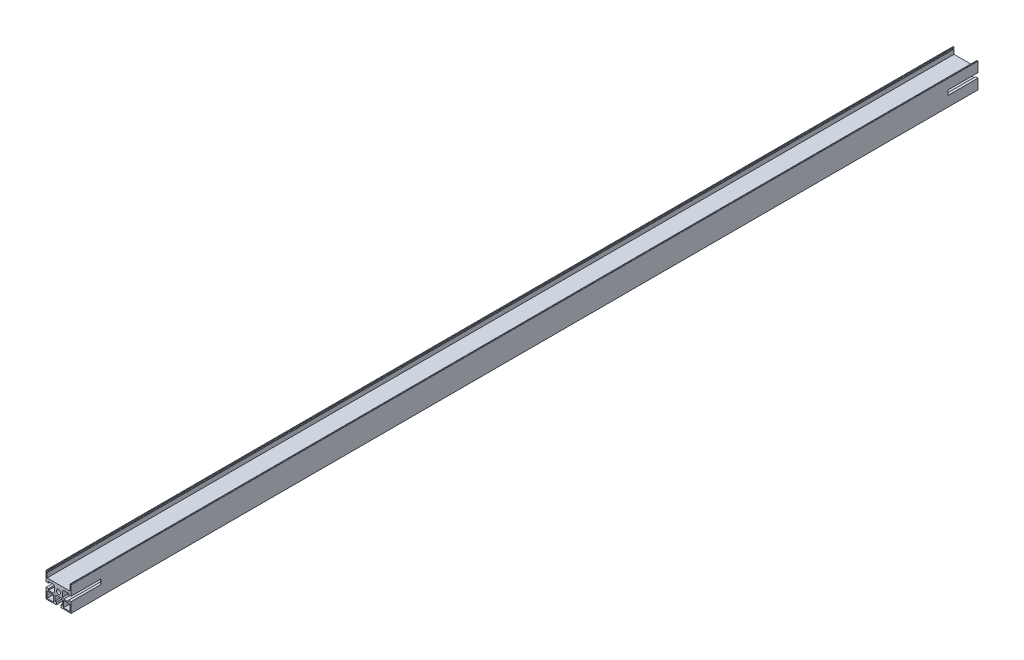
from build123d import *

# Parameters (mm, degrees)
EXTRUDE1_DEPTH      = 812.9995
EXTRUDE1_DEPTH_BACK = 812.9995
SKETCH1_R           = 3.75
SKETCH1_W           = 11.7
SKETCH1_H           = 11.7
SKETCH2_W           = 53.975
SKETCH2_H           = 8.5
EXTRUDE2_DEPTH      = 6.35


with BuildPart() as part:
    # Sketch1 → Extrude1 (new, two sides: drawn at the far end of the back side and taken through both)
    with BuildSketch(Plane.XY.offset(-EXTRUDE1_DEPTH_BACK)):
        with BuildLine():
            Line((-22.5, 22), (-22.5, -22.5))
            Line((-22.5, -22.5), (-4.1, -22.5))
            Line((-4.1, -22.5), (-4.1, -18))
            Line((-4.1, -18), (-6.8, -18))
            Line((-6.8, -18), (-6.8, -9.5))
            Line((-6.8, -9.5), (-4.5, -7.2))
            Line((-4.5, -7.2), (4.5, -7.2))
            Line((4.5, -7.2), (6.8, -9.5))
            Line((6.8, -9.5), (6.8, -18))
            Line((6.8, -18), (4.1, -18))
            Line((4.1, -18), (4.1, -22.5))
            Line((4.1, -22.5), (22.5, -22.5))
            Line((22.5, -22.5), (22.5, 22))
            ThreePointArc((22.5, 22), (22.353553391, 22.353553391), (22, 22.5))
            Line((22, 22.5), (21, 22.5))
            ThreePointArc((21, 22.5), (20.646446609, 22.353553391), (20.5, 22))
            Line((20.5, 22), (20.5, 21.768857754))
            ThreePointArc((20.5, 21.768857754), (20.562202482, 21.527334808), (20.733333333, 21.345905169))
            ThreePointArc((20.733333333, 21.345905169), (21.2, 20.5), (20.733333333, 19.654094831))
            ThreePointArc((20.733333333, 19.654094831), (20.562202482, 19.472665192), (20.5, 19.231142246))
            Line((20.5, 19.231142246), (20.5, 11.221393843))
            Line((20.5, 11.221393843), (-20.5, 11.221393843))
            Line((-20.5, 11.221393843), (-20.5, 19.231142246))
            ThreePointArc((-20.5, 19.231142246), (-20.562202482, 19.472665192), (-20.733333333, 19.654094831))
            ThreePointArc((-20.733333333, 19.654094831), (-21.2, 20.5), (-20.733333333, 21.345905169))
            ThreePointArc((-20.733333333, 21.345905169), (-20.562202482, 21.527334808), (-20.5, 21.768857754))
            Line((-20.5, 21.768857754), (-20.5, 22))
            ThreePointArc((-20.5, 22), (-20.646446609, 22.353553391), (-21, 22.5))
            Line((-21, 22.5), (-22, 22.5))
            ThreePointArc((-22, 22.5), (-22.353553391, 22.353553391), (-22.5, 22))
        make_face()
        Circle(SKETCH1_R, mode=Mode.SUBTRACT)
        with BuildLine():
            Line((-7.2, -4.8), (-7.2, 4.8))
            Line((-7.2, 4.8), (-9.2, 6.8))
            Line((-9.2, 6.8), (-18, 6.8))
            Line((-18, 6.8), (-18, 4.25))
            Line((-18, 4.25), (-22.2, 4.25))
            Line((-22.2, 4.25), (-22.2, 3.95))
            Line((-22.2, 3.95), (-21.732233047, 3.482233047))
            ThreePointArc((-21.732233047, 3.482233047), (-21.190301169, 2.671174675), (-21, 1.714466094))
            Line((-21, 1.714466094), (-21, -1.714466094))
            ThreePointArc((-21, -1.714466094), (-21.190301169, -2.671174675), (-21.732233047, -3.482233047))
            Line((-21.732233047, -3.482233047), (-22.2, -3.95))
            Line((-22.2, -3.95), (-22.2, -4.25))
            Line((-22.2, -4.25), (-18, -4.25))
            Line((-18, -4.25), (-18, -6.8))
            Line((-18, -6.8), (-9.2, -6.8))
            Line((-9.2, -6.8), (-7.2, -4.8))
        make_face(mode=Mode.SUBTRACT)
        with Locations((-14.65, -14.65)):
            Rectangle(SKETCH1_W, SKETCH1_H, mode=Mode.SUBTRACT)
        with BuildLine():
            Line((22.2, -3.95), (21.732233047, -3.482233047))
            ThreePointArc((21.732233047, -3.482233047), (21.190301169, -2.671174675), (21, -1.714466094))
            Line((21, -1.714466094), (21, 1.714466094))
            ThreePointArc((21, 1.714466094), (21.190301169, 2.671174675), (21.732233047, 3.482233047))
            Line((21.732233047, 3.482233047), (22.2, 3.95))
            Line((22.2, 3.95), (22.2, 4.25))
            Line((22.2, 4.25), (18, 4.25))
            Line((18, 4.25), (18, 6.8))
            Line((18, 6.8), (9.2, 6.8))
            Line((9.2, 6.8), (7.2, 4.8))
            Line((7.2, 4.8), (7.2, -4.8))
            Line((7.2, -4.8), (9.2, -6.8))
            Line((9.2, -6.8), (18, -6.8))
            Line((18, -6.8), (18, -4.25))
            Line((18, -4.25), (22.2, -4.25))
            Line((22.2, -4.25), (22.2, -3.95))
        make_face(mode=Mode.SUBTRACT)
        with Locations((14.65, -14.65)):
            Rectangle(SKETCH1_W, SKETCH1_H, mode=Mode.SUBTRACT)
    extrude(amount=EXTRUDE1_DEPTH + EXTRUDE1_DEPTH_BACK)

    # Sketch2 → Extrude2 (cut)
    with BuildSketch(Plane(origin=(22.5, 0, 0), x_dir=(0, 0, -1), z_dir=(1, 0, 0))):
        with Locations((-786.012, 0)):
            Rectangle(SKETCH2_W, SKETCH2_H)
        with Locations((786.012, 0)):
            Rectangle(SKETCH2_W, SKETCH2_H)
    extrude2 = extrude(amount=-EXTRUDE2_DEPTH, mode=Mode.SUBTRACT)

    # Mirror1: Extrude2 across plane
    add(extrude2.mirror(Plane(origin=(0, 0, 0), x_dir=(0, 0, 1), z_dir=(1, 0, 0))), mode=Mode.SUBTRACT)


solid = part.part
